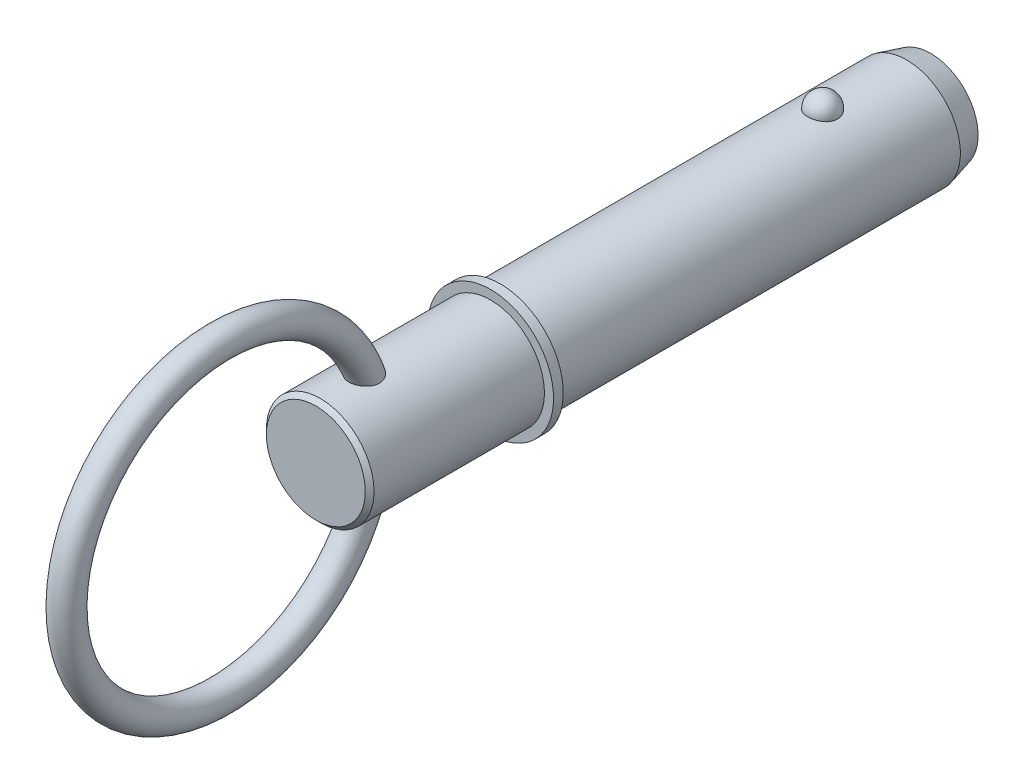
ISO-10303-21;
HEADER;
FILE_DESCRIPTION(('STEP AP214'),'2;1');
FILE_NAME('part.step','',(''),(''),'','','');
FILE_SCHEMA(('AUTOMOTIVE_DESIGN { 1 0 10303 214 1 1 1 1 }'));
ENDSEC;
DATA;
#1=APPLICATION_CONTEXT('core data for automotive mechanical design processes');
#2=APPLICATION_PROTOCOL_DEFINITION('international standard','automotive_design',2000,#1);
#3=PRODUCT_CONTEXT('',#1,'mechanical');
#4=PRODUCT('Part','Part','',(#3));
#5=PRODUCT_RELATED_PRODUCT_CATEGORY('part','',(#4));
#6=PRODUCT_DEFINITION_FORMATION('','',#4);
#7=PRODUCT_DEFINITION_CONTEXT('part definition',#1,'design');
#8=PRODUCT_DEFINITION('design','',#6,#7);
#9=PRODUCT_DEFINITION_SHAPE('','',#8);
#10=(LENGTH_UNIT() NAMED_UNIT(*) SI_UNIT(.MILLI.,.METRE.));
#11=(NAMED_UNIT(*) PLANE_ANGLE_UNIT() SI_UNIT($,.RADIAN.));
#12=(NAMED_UNIT(*) SI_UNIT($,.STERADIAN.) SOLID_ANGLE_UNIT());
#13=UNCERTAINTY_MEASURE_WITH_UNIT(LENGTH_MEASURE(1.E-05),#10,'distance_accuracy_value','');
#14=(GEOMETRIC_REPRESENTATION_CONTEXT(3) GLOBAL_UNCERTAINTY_ASSIGNED_CONTEXT((#13)) GLOBAL_UNIT_ASSIGNED_CONTEXT((#10,
#11,#12)) REPRESENTATION_CONTEXT('',''));
#15=CARTESIAN_POINT('',(0.,0.,0.));
#16=DIRECTION('',(0.,0.,1.));
#17=DIRECTION('',(1.,0.,0.));
#18=AXIS2_PLACEMENT_3D('',#15,#16,#17);
#19=CARTESIAN_POINT('',(0.,0.,63.5));
#20=DIRECTION('',(0.,0.,-1.));
#21=DIRECTION('',(-1.,0.,0.));
#22=AXIS2_PLACEMENT_3D('',#19,#20,#21);
#23=CYLINDRICAL_SURFACE('',#22,11.115);
#24=CARTESIAN_POINT('',(3.04058343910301,10.6910278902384,-3.07));
#25=CARTESIAN_POINT('',(3.04058039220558,10.6910304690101,-2.89837124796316));
#26=CARTESIAN_POINT('',(3.02657193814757,10.6950430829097,-2.72670368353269));
#27=CARTESIAN_POINT('',(2.97087341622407,10.7106465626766,-2.38822964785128));
#28=CARTESIAN_POINT('',(2.92917240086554,10.7222404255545,-2.22142512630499));
#29=CARTESIAN_POINT('',(2.81915317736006,10.751689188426,-1.89750816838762));
#30=CARTESIAN_POINT('',(2.75084669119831,10.7695413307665,-1.7403914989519));
#31=CARTESIAN_POINT('',(2.58932284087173,10.809510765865,-1.44013959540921));
#32=CARTESIAN_POINT('',(2.49610617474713,10.8316279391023,-1.29700396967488));
#33=CARTESIAN_POINT('',(2.28659317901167,10.877786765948,-1.02797591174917));
#34=CARTESIAN_POINT('',(2.17018825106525,10.9018371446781,-0.902169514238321));
#35=CARTESIAN_POINT('',(1.91759004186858,10.9490888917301,-0.672091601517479));
#36=CARTESIAN_POINT('',(1.78139672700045,10.9722902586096,-0.567820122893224));
#37=CARTESIAN_POINT('',(1.49327884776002,11.0151925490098,-0.383992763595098));
#38=CARTESIAN_POINT('',(1.34139928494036,11.034903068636,-0.304368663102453));
#39=CARTESIAN_POINT('',(1.02584823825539,11.0686948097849,-0.17173147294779));
#40=CARTESIAN_POINT('',(0.86217801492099,11.0827766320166,-0.118715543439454));
#41=CARTESIAN_POINT('',(0.530748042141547,11.1035404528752,-0.0415304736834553));
#42=CARTESIAN_POINT('',(0.363109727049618,11.1103474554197,-0.0168734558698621));
#43=CARTESIAN_POINT('',(0.0259327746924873,11.1162480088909,0.00453486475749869));
#44=CARTESIAN_POINT('',(-0.143605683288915,11.1153422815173,0.00128877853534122));
#45=CARTESIAN_POINT('',(-0.477280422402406,11.1059854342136,-0.0327676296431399));
#46=CARTESIAN_POINT('',(-0.641459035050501,11.0976393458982,-0.0631942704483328));
#47=CARTESIAN_POINT('',(-0.962236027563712,11.0744390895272,-0.150220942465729));
#48=CARTESIAN_POINT('',(-1.11883427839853,11.0595848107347,-0.206821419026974));
#49=CARTESIAN_POINT('',(-1.4210461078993,11.0248420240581,-0.34502889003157));
#50=CARTESIAN_POINT('',(-1.56659244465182,11.0049254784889,-0.426775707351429));
#51=CARTESIAN_POINT('',(-1.84189316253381,10.9622119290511,-0.612956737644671));
#52=CARTESIAN_POINT('',(-1.97164597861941,10.9394146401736,-0.717393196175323));
#53=CARTESIAN_POINT('',(-2.21432263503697,10.8929139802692,-0.948332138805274));
#54=CARTESIAN_POINT('',(-2.3268890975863,10.8692016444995,-1.07520847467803));
#55=CARTESIAN_POINT('',(-2.52940007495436,10.8238699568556,-1.34622145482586));
#56=CARTESIAN_POINT('',(-2.6193430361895,10.8022507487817,-1.49035928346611));
#57=CARTESIAN_POINT('',(-2.77523958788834,10.7632629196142,-1.79367507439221));
#58=CARTESIAN_POINT('',(-2.8409151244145,10.7459442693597,-1.95300253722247));
#59=CARTESIAN_POINT('',(-2.94519180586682,10.7178360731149,-2.28083009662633));
#60=CARTESIAN_POINT('',(-2.98379371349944,10.707046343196,-2.44932993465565));
#61=CARTESIAN_POINT('',(-3.03284665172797,10.6932559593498,-2.78998091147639));
#62=CARTESIAN_POINT('',(-3.04341313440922,10.6902233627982,-2.96211412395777));
#63=CARTESIAN_POINT('',(-3.03646037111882,10.6922002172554,-3.305762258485));
#64=CARTESIAN_POINT('',(-3.0189418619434,10.6972094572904,-3.47727719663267));
#65=CARTESIAN_POINT('',(-2.95641582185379,10.7146564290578,-3.81396465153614));
#66=CARTESIAN_POINT('',(-2.91154117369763,10.7270582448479,-3.97916375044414));
#67=CARTESIAN_POINT('',(-2.79553341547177,10.7578713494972,-4.29947360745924));
#68=CARTESIAN_POINT('',(-2.72439927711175,10.7762828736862,-4.45458397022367));
#69=CARTESIAN_POINT('',(-2.55718900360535,10.8171819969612,-4.75123550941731));
#70=CARTESIAN_POINT('',(-2.46098224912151,10.8396907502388,-4.89270014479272));
#71=CARTESIAN_POINT('',(-2.24623042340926,10.8862165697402,-5.15724095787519));
#72=CARTESIAN_POINT('',(-2.12768452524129,10.9102336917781,-5.28031645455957));
#73=CARTESIAN_POINT('',(-1.87085107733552,10.9571990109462,-5.5050961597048));
#74=CARTESIAN_POINT('',(-1.73249451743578,10.9801430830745,-5.60672245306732));
#75=CARTESIAN_POINT('',(-1.44010079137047,11.0223008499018,-5.78517789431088));
#76=CARTESIAN_POINT('',(-1.28606470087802,11.0415148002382,-5.86200874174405));
#77=CARTESIAN_POINT('',(-0.968615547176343,11.0738491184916,-5.98788441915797));
#78=CARTESIAN_POINT('',(-0.805339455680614,11.0870408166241,-6.03725610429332));
#79=CARTESIAN_POINT('',(-0.47244987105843,11.1062048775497,-6.10820004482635));
#80=CARTESIAN_POINT('',(-0.302837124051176,11.11217808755,-6.1297755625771));
#81=CARTESIAN_POINT('',(0.0345765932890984,11.1162034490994,-6.1443619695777));
#82=CARTESIAN_POINT('',(0.20235372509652,11.1143988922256,-6.13788957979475));
#83=CARTESIAN_POINT('',(0.534364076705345,11.103390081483,-6.09773981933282));
#84=CARTESIAN_POINT('',(0.698597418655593,11.094186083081,-6.06406338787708));
#85=CARTESIAN_POINT('',(1.01830314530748,11.0694136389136,-5.97063285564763));
#86=CARTESIAN_POINT('',(1.17380497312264,11.0538682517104,-5.91097318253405));
#87=CARTESIAN_POINT('',(1.472484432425,11.0180608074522,-5.76723645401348));
#88=CARTESIAN_POINT('',(1.6156613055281,10.9977984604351,-5.68315789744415));
#89=CARTESIAN_POINT('',(1.88801614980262,10.9543574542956,-5.49138807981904));
#90=CARTESIAN_POINT('',(2.01695079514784,10.9311394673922,-5.38336024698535));
#91=CARTESIAN_POINT('',(2.25501495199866,10.8845248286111,-5.14733839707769));
#92=CARTESIAN_POINT('',(2.36414099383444,10.8611281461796,-5.01934088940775));
#93=CARTESIAN_POINT('',(2.56152595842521,10.8162958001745,-4.74447932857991));
#94=CARTESIAN_POINT('',(2.64940088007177,10.7948999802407,-4.59733288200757));
#95=CARTESIAN_POINT('',(2.79961494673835,10.7569242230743,-4.29001203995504));
#96=CARTESIAN_POINT('',(2.86196390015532,10.7403424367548,-4.12984267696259));
#97=CARTESIAN_POINT('',(2.95377333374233,10.715429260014,-3.820623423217));
#98=CARTESIAN_POINT('',(2.98627018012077,10.7063495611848,-3.67252681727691));
#99=CARTESIAN_POINT('',(3.02967634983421,10.6941478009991,-3.37296350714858));
#100=CARTESIAN_POINT('',(3.04058612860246,10.6910256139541,-3.2214968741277));
#101=CARTESIAN_POINT('',(3.04058343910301,10.6910278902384,-3.07));
#102=B_SPLINE_CURVE_WITH_KNOTS('',3,(#24,#25,#26,#27,#28,#29,#30,#31,#32,#33,#34,#35,#36,#37,
#38,#39,#40,#41,#42,#43,#44,#45,#46,#47,#48,#49,#50,#51,#52,#53,#54,#55,#56,#57,#58,#59,#60,#61,
#62,#63,#64,#65,#66,#67,#68,#69,#70,#71,#72,#73,#74,#75,#76,#77,#78,#79,#80,#81,#82,#83,#84,#85,
#86,#87,#88,#89,#90,#91,#92,#93,#94,#95,#96,#97,#98,#99,#100,#101),.UNSPECIFIED.,.T.,.F.,(4,2,2,
2,2,2,2,2,2,2,2,2,2,2,2,2,2,2,2,2,2,2,2,2,2,2,2,2,2,2,2,2,2,2,2,2,2,2,4),(0.,0.514341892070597,
1.02888723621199,1.54320613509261,2.0575106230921,2.57428293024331,3.09105611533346,
3.60638589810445,4.1216606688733,4.62793159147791,5.1341551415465,5.63334381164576,
6.13254097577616,6.63456562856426,7.13663998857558,7.64804063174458,8.15947638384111,
8.6766026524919,9.19371435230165,9.70869321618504,10.223658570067,10.7361421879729,
11.2486458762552,11.7638748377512,12.2791228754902,12.7962115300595,13.3132647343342,
13.8240238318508,14.3347229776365,14.8360540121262,15.3373677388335,15.8368746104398,
16.3364121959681,16.8434736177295,17.3506237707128,17.8663484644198,18.3818748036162,
18.8358944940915,19.2899046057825),.UNSPECIFIED.);
#103=CARTESIAN_POINT('',(3.04058343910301,10.6910278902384,-3.07));
#104=VERTEX_POINT('',#103);
#105=EDGE_CURVE('E100',#104,#104,#102,.T.);
#106=ORIENTED_EDGE('',*,*,#105,.T.);
#107=EDGE_LOOP('',(#106));
#108=FACE_BOUND('',#107,.T.);
#109=CARTESIAN_POINT('',(0.,0.,-20.4));
#110=DIRECTION('',(0.,0.,-1.));
#111=DIRECTION('',(-1.,0.,0.));
#112=AXIS2_PLACEMENT_3D('',#109,#110,#111);
#113=CIRCLE('',#112,11.115);
#114=CARTESIAN_POINT('',(-11.115,0.,-20.4));
#115=VERTEX_POINT('',#114);
#116=EDGE_CURVE('E108',#115,#115,#113,.F.);
#117=ORIENTED_EDGE('',*,*,#116,.T.);
#118=EDGE_LOOP('',(#117));
#119=FACE_BOUND('',#118,.T.);
#120=CARTESIAN_POINT('',(0.,0.,63.5));
#121=DIRECTION('',(0.,0.,1.));
#122=DIRECTION('',(1.,0.,0.));
#123=AXIS2_PLACEMENT_3D('',#120,#121,#122);
#124=CIRCLE('',#123,11.115);
#125=CARTESIAN_POINT('',(11.115,0.,63.5));
#126=VERTEX_POINT('',#125);
#127=EDGE_CURVE('E106',#126,#126,#124,.T.);
#128=ORIENTED_EDGE('',*,*,#127,.F.);
#129=EDGE_LOOP('',(#128));
#130=FACE_BOUND('',#129,.T.);
#131=ADVANCED_FACE('F39',(#108,#119,#130),#23,.T.);
#132=CARTESIAN_POINT('',(0.,0.,-25.4));
#133=DIRECTION('',(0.,0.,-1.));
#134=DIRECTION('',(-1.,0.,0.));
#135=AXIS2_PLACEMENT_3D('',#132,#133,#134);
#136=PLANE('',#135);
#137=CARTESIAN_POINT('',(0.,0.,-25.4));
#138=DIRECTION('',(0.,0.,-1.));
#139=DIRECTION('',(-1.,0.,0.));
#140=AXIS2_PLACEMENT_3D('',#137,#138,#139);
#141=CIRCLE('',#140,9.77525403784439);
#142=CARTESIAN_POINT('',(-9.77525403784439,0.,-25.4));
#143=VERTEX_POINT('',#142);
#144=EDGE_CURVE('E143',#143,#143,#141,.T.);
#145=ORIENTED_EDGE('',*,*,#144,.T.);
#146=EDGE_LOOP('',(#145));
#147=FACE_BOUND('',#146,.T.);
#148=ADVANCED_FACE('F86',(#147),#136,.T.);
#149=CARTESIAN_POINT('',(0.,0.,-25.4));
#150=DIRECTION('',(0.,0.,1.));
#151=DIRECTION('',(1.,0.,0.));
#152=AXIS2_PLACEMENT_3D('',#149,#150,#151);
#153=CONICAL_SURFACE('',#152,9.77525403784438,0.261799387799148);
#154=ORIENTED_EDGE('',*,*,#116,.F.);
#155=EDGE_LOOP('',(#154));
#156=FACE_BOUND('',#155,.T.);
#157=ORIENTED_EDGE('',*,*,#144,.F.);
#158=EDGE_LOOP('',(#157));
#159=FACE_BOUND('',#158,.T.);
#160=ADVANCED_FACE('F92',(#156,#159),#153,.T.);
#161=CARTESIAN_POINT('',(0.,11.115,-3.07));
#162=DIRECTION('',(0.,1.,0.));
#163=DIRECTION('',(0.,0.,1.));
#164=AXIS2_PLACEMENT_3D('',#161,#162,#163);
#165=SPHERICAL_SURFACE('',#164,3.07);
#166=ORIENTED_EDGE('',*,*,#105,.F.);
#167=EDGE_LOOP('',(#166));
#168=FACE_BOUND('',#167,.T.);
#169=ADVANCED_FACE('F111',(#168),#165,.T.);
#170=CARTESIAN_POINT('',(0.,0.,63.5));
#171=DIRECTION('',(0.,0.,-1.));
#172=DIRECTION('',(-1.,0.,0.));
#173=AXIS2_PLACEMENT_3D('',#170,#171,#172);
#174=PLANE('',#173);
#175=ORIENTED_EDGE('',*,*,#127,.T.);
#176=EDGE_LOOP('',(#175));
#177=FACE_BOUND('',#176,.T.);
#178=CARTESIAN_POINT('',(0.,0.,63.5));
#179=DIRECTION('',(0.,0.,-1.));
#180=DIRECTION('',(-1.,0.,0.));
#181=AXIS2_PLACEMENT_3D('',#178,#179,#180);
#182=CIRCLE('',#181,13.);
#183=CARTESIAN_POINT('',(-13.,0.,63.5));
#184=VERTEX_POINT('',#183);
#185=EDGE_CURVE('E107',#184,#184,#182,.T.);
#186=ORIENTED_EDGE('',*,*,#185,.T.);
#187=EDGE_LOOP('',(#186));
#188=FACE_BOUND('',#187,.T.);
#189=ADVANCED_FACE('F115',(#177,#188),#174,.T.);
#190=CARTESIAN_POINT('',(0.,0.,33.7287874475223));
#191=DIRECTION('',(0.,0.,-1.));
#192=DIRECTION('',(-1.,0.,0.));
#193=AXIS2_PLACEMENT_3D('',#190,#191,#192);
#194=CYLINDRICAL_SURFACE('',#193,13.);
#195=CARTESIAN_POINT('',(0.,0.,65.5));
#196=DIRECTION('',(0.,0.,-1.));
#197=DIRECTION('',(-1.,0.,0.));
#198=AXIS2_PLACEMENT_3D('',#195,#196,#197);
#199=CIRCLE('',#198,13.);
#200=CARTESIAN_POINT('',(-13.,0.,65.5));
#201=VERTEX_POINT('',#200);
#202=EDGE_CURVE('E132',#201,#201,#199,.T.);
#203=ORIENTED_EDGE('',*,*,#202,.T.);
#204=EDGE_LOOP('',(#203));
#205=FACE_BOUND('',#204,.T.);
#206=ORIENTED_EDGE('',*,*,#185,.F.);
#207=EDGE_LOOP('',(#206));
#208=FACE_BOUND('',#207,.T.);
#209=ADVANCED_FACE('F119',(#205,#208),#194,.T.);
#210=CARTESIAN_POINT('',(0.,13.,65.5));
#211=DIRECTION('',(0.,0.,1.));
#212=DIRECTION('',(1.,0.,0.));
#213=AXIS2_PLACEMENT_3D('',#210,#211,#212);
#214=PLANE('',#213);
#215=CARTESIAN_POINT('',(0.,0.,65.5));
#216=DIRECTION('',(0.,0.,1.));
#217=DIRECTION('',(1.,0.,0.));
#218=AXIS2_PLACEMENT_3D('',#215,#216,#217);
#219=CIRCLE('',#218,11.115);
#220=CARTESIAN_POINT('',(11.115,0.,65.5));
#221=VERTEX_POINT('',#220);
#222=EDGE_CURVE('E110',#221,#221,#219,.T.);
#223=ORIENTED_EDGE('',*,*,#222,.F.);
#224=EDGE_LOOP('',(#223));
#225=FACE_BOUND('',#224,.T.);
#226=ORIENTED_EDGE('',*,*,#202,.F.);
#227=EDGE_LOOP('',(#226));
#228=FACE_BOUND('',#227,.T.);
#229=ADVANCED_FACE('F83',(#225,#228),#214,.T.);
#230=CARTESIAN_POINT('',(0.,0.,101.6));
#231=DIRECTION('',(0.,0.,-1.));
#232=DIRECTION('',(-1.,0.,0.));
#233=AXIS2_PLACEMENT_3D('',#230,#231,#232);
#234=CYLINDRICAL_SURFACE('',#233,11.115);
#235=CARTESIAN_POINT('',(-1.22435852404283,-11.0473603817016,88.6784197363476));
#236=CARTESIAN_POINT('',(-1.07078016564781,-11.0643805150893,88.6116991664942));
#237=CARTESIAN_POINT('',(-0.911372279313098,-11.0787777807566,88.5577454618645));
#238=CARTESIAN_POINT('',(-0.585451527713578,-11.1007717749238,88.4765522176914));
#239=CARTESIAN_POINT('',(-0.418938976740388,-11.1083688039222,88.4493114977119));
#240=CARTESIAN_POINT('',(-0.0835394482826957,-11.1159515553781,88.4221212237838));
#241=CARTESIAN_POINT('',(0.085347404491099,-11.1159376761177,88.4221702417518));
#242=CARTESIAN_POINT('',(0.420723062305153,-11.1083011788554,88.4495547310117));
#243=CARTESIAN_POINT('',(0.587211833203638,-11.1006784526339,88.4768905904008));
#244=CARTESIAN_POINT('',(0.91318995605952,-11.0786293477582,88.5582995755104));
#245=CARTESIAN_POINT('',(1.07267378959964,-11.0641977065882,88.6123933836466));
#246=CARTESIAN_POINT('',(1.37994044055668,-11.0300907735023,88.7461408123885));
#247=CARTESIAN_POINT('',(1.52772335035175,-11.0104155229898,88.8257942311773));
#248=CARTESIAN_POINT('',(1.80679367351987,-10.9680716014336,89.0084678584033));
#249=CARTESIAN_POINT('',(1.93814041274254,-10.945414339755,89.1114000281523));
#250=CARTESIAN_POINT('',(2.18117403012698,-10.8995884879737,89.338212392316));
#251=CARTESIAN_POINT('',(2.29286356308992,-10.8764199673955,89.4620897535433));
#252=CARTESIAN_POINT('',(2.49238969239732,-10.8324319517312,89.7259926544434));
#253=CARTESIAN_POINT('',(2.58046870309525,-10.8115899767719,89.8658312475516));
#254=CARTESIAN_POINT('',(2.73218762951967,-10.7742522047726,90.1586913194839));
#255=CARTESIAN_POINT('',(2.7958294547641,-10.757756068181,90.3117117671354));
#256=CARTESIAN_POINT('',(2.89767977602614,-10.7307723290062,90.6266092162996));
#257=CARTESIAN_POINT('',(2.93586554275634,-10.7202900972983,90.7884939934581));
#258=CARTESIAN_POINT('',(2.98678800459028,-10.7062139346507,91.1164805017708));
#259=CARTESIAN_POINT('',(2.99951894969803,-10.7026215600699,91.2825831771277));
#260=CARTESIAN_POINT('',(3.0004780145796,-10.7023530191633,91.6232270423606));
#261=CARTESIAN_POINT('',(2.98743421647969,-10.7060358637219,91.7977701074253));
#262=CARTESIAN_POINT('',(2.93592917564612,-10.7202719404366,92.1427508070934));
#263=CARTESIAN_POINT('',(2.8974582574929,-10.7308277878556,92.3131868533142));
#264=CARTESIAN_POINT('',(2.79180512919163,-10.7588257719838,92.6631149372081));
#265=CARTESIAN_POINT('',(2.72213928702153,-10.776850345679,92.8418115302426));
#266=CARTESIAN_POINT('',(2.55612841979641,-10.8174264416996,93.1859744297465));
#267=CARTESIAN_POINT('',(2.45975697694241,-10.8399824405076,93.3514274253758));
#268=CARTESIAN_POINT('',(2.23434632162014,-10.8887625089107,93.675672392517));
#269=CARTESIAN_POINT('',(2.10349593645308,-10.9151327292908,93.8331925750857));
#270=CARTESIAN_POINT('',(1.81505097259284,-10.96677510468,94.1216682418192));
#271=CARTESIAN_POINT('',(1.65749731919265,-10.9920488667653,94.2526637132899));
#272=CARTESIAN_POINT('',(1.36197799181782,-11.0319737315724,94.4513134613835));
#273=CARTESIAN_POINT('',(1.22927684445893,-11.0476896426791,94.5266009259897));
#274=CARTESIAN_POINT('',(0.952979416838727,-11.0749380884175,94.6545744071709));
#275=CARTESIAN_POINT('',(0.809393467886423,-11.0864745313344,94.7072815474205));
#276=CARTESIAN_POINT('',(0.513954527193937,-11.1041011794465,94.7870588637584));
#277=CARTESIAN_POINT('',(0.362058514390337,-11.1101594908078,94.8139789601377));
#278=CARTESIAN_POINT('',(0.0557792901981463,-11.1159132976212,94.8395595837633));
#279=CARTESIAN_POINT('',(-0.0986030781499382,-11.1156109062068,94.8382294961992));
#280=CARTESIAN_POINT('',(-0.389768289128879,-11.1090283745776,94.8089352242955));
#281=CARTESIAN_POINT('',(-0.526830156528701,-11.1033186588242,94.7835124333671));
#282=CARTESIAN_POINT('',(-0.794878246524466,-11.0873547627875,94.7112701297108));
#283=CARTESIAN_POINT('',(-0.925863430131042,-11.0770998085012,94.6644469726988));
#284=CARTESIAN_POINT('',(-1.18354406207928,-11.0525934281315,94.5498438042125));
#285=CARTESIAN_POINT('',(-1.30991621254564,-11.0382116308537,94.4813711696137));
#286=CARTESIAN_POINT('',(-1.55122352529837,-11.0068962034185,94.3271312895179));
#287=CARTESIAN_POINT('',(-1.66615377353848,-10.9899614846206,94.2413566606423));
#288=CARTESIAN_POINT('',(-1.90024050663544,-10.9520991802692,94.0408720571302));
#289=CARTESIAN_POINT('',(-2.01728342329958,-10.9309598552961,93.9237372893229));
#290=CARTESIAN_POINT('',(-2.23333659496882,-10.8888735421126,93.6738397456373));
#291=CARTESIAN_POINT('',(-2.33233396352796,-10.8679267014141,93.5410659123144));
#292=CARTESIAN_POINT('',(-2.52607041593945,-10.8246766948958,93.2400006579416));
#293=CARTESIAN_POINT('',(-2.61741570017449,-10.8027194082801,93.0694627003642));
#294=CARTESIAN_POINT('',(-2.77251687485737,-10.7639568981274,92.7156715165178));
#295=CARTESIAN_POINT('',(-2.8362578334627,-10.7471544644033,92.5324114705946));
#296=CARTESIAN_POINT('',(-2.93668505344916,-10.7201706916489,92.1466242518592));
#297=CARTESIAN_POINT('',(-2.97161961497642,-10.7104219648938,91.943594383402));
#298=CARTESIAN_POINT('',(-2.99683495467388,-10.7033740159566,91.6368749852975));
#299=CARTESIAN_POINT('',(-3.00070536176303,-10.7022882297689,91.5342341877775));
#300=CARTESIAN_POINT('',(-2.99908594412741,-10.7027439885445,91.3290499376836));
#301=CARTESIAN_POINT('',(-2.99360154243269,-10.7042840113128,91.2265064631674));
#302=CARTESIAN_POINT('',(-2.97382504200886,-10.7097936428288,91.0303300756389));
#303=CARTESIAN_POINT('',(-2.9602439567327,-10.7135669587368,90.9366192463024));
#304=CARTESIAN_POINT('',(-2.92480741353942,-10.723295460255,90.750932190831));
#305=CARTESIAN_POINT('',(-2.90295619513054,-10.7292495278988,90.6589551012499));
#306=CARTESIAN_POINT('',(-2.8509700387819,-10.7431800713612,90.4775474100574));
#307=CARTESIAN_POINT('',(-2.82083748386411,-10.7511559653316,90.3881160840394));
#308=CARTESIAN_POINT('',(-2.75241691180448,-10.7688750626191,90.2126453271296));
#309=CARTESIAN_POINT('',(-2.71412954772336,-10.7786181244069,90.1266056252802));
#310=CARTESIAN_POINT('',(-2.59550576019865,-10.807996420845,89.8910554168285));
#311=CARTESIAN_POINT('',(-2.50612224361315,-10.8292837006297,89.7461731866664));
#312=CARTESIAN_POINT('',(-2.30366035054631,-10.8741467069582,89.4745713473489));
#313=CARTESIAN_POINT('',(-2.19058370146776,-10.8977222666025,89.3478504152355));
#314=CARTESIAN_POINT('',(-1.94442412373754,-10.9443154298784,89.1164621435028));
#315=CARTESIAN_POINT('',(-1.81141354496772,-10.967334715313,89.0117182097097));
#316=CARTESIAN_POINT('',(-1.529042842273,-11.0102504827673,88.8264358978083));
#317=CARTESIAN_POINT('',(-1.37968206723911,-11.0301468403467,88.7458984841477));
#318=CARTESIAN_POINT('',(-1.22435852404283,-11.0473603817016,88.6784197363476));
#319=B_SPLINE_CURVE_WITH_KNOTS('',3,(#235,#236,#237,#238,#239,#240,#241,#242,#243,#244,#245,
#246,#247,#248,#249,#250,#251,#252,#253,#254,#255,#256,#257,#258,#259,#260,#261,#262,#263,#264,
#265,#266,#267,#268,#269,#270,#271,#272,#273,#274,#275,#276,#277,#278,#279,#280,#281,#282,#283,
#284,#285,#286,#287,#288,#289,#290,#291,#292,#293,#294,#295,#296,#297,#298,#299,#300,#301,#302,
#303,#304,#305,#306,#307,#308,#309,#310,#311,#312,#313,#314,#315,#316,#317,#318),.UNSPECIFIED.,
.T.,.F.,(4,2,2,2,2,2,2,2,2,2,2,2,2,2,2,2,2,2,2,2,2,2,2,2,2,2,2,2,2,2,2,2,2,2,2,2,2,2,2,2,2,4),
(0.,0.504317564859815,1.00861284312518,1.51288173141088,2.01715779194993,2.52182424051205,
3.02648670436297,3.52927157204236,4.03198848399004,4.52932690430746,5.02662645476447,
5.5243694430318,6.0222248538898,6.545261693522,7.06849767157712,7.64398785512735,
8.22004937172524,8.83633461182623,9.45168373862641,9.90997173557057,10.3678300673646,
10.8283372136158,11.2886913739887,11.7053264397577,12.1220324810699,12.5537129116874,
12.9855779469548,13.4844842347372,13.9837454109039,14.5653303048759,15.1472294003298,
15.762338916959,16.0701226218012,16.3777279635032,16.6616380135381,16.9454027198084,
17.229085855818,17.5127462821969,18.0246262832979,18.5364689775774,19.0464970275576,
19.5565453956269),.UNSPECIFIED.);
#320=CARTESIAN_POINT('',(-1.22435852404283,-11.0473603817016,88.6784197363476));
#321=VERTEX_POINT('',#320);
#322=EDGE_CURVE('E10',#321,#321,#319,.T.);
#323=ORIENTED_EDGE('',*,*,#322,.F.);
#324=EDGE_LOOP('',(#323));
#325=FACE_BOUND('',#324,.T.);
#326=CARTESIAN_POINT('',(-1.22435852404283,11.0473603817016,88.6784197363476));
#327=CARTESIAN_POINT('',(-1.37630771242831,11.0305212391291,88.744431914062));
#328=CARTESIAN_POINT('',(-1.52254325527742,11.0111158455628,88.8229381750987));
#329=CARTESIAN_POINT('',(-1.79945383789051,10.9692671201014,89.0031533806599));
#330=CARTESIAN_POINT('',(-1.93013010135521,10.9468240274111,89.1048604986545));
#331=CARTESIAN_POINT('',(-2.17227655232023,10.9013603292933,89.3290359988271));
#332=CARTESIAN_POINT('',(-2.28373752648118,10.8783394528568,89.4515142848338));
#333=CARTESIAN_POINT('',(-2.48427458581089,10.8343057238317,89.7138954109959));
#334=CARTESIAN_POINT('',(-2.57335330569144,10.8132926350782,89.8537961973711));
#335=CARTESIAN_POINT('',(-2.7264007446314,10.7757209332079,90.1459648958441));
#336=CARTESIAN_POINT('',(-2.79054231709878,10.7591319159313,90.2981385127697));
#337=CARTESIAN_POINT('',(-2.89354234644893,10.7318913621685,90.6112862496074));
#338=CARTESIAN_POINT('',(-2.93239912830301,10.7212402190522,90.7722609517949));
#339=CARTESIAN_POINT('',(-2.98540436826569,10.7066038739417,91.1019559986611));
#340=CARTESIAN_POINT('',(-2.9990165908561,10.7027634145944,91.2707680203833));
#341=CARTESIAN_POINT('',(-3.0008814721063,10.7022388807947,91.6085087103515));
#342=CARTESIAN_POINT('',(-2.98912652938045,10.7055569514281,91.7774373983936));
#343=CARTESIAN_POINT('',(-2.93985175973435,10.7191979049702,92.1248560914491));
#344=CARTESIAN_POINT('',(-2.90036626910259,10.7300544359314,92.3030445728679));
#345=CARTESIAN_POINT('',(-2.7955500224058,10.7578360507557,92.6512150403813));
#346=CARTESIAN_POINT('',(-2.73019988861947,10.774765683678,92.8211907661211));
#347=CARTESIAN_POINT('',(-2.56762574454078,10.8147227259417,93.1657841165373));
#348=CARTESIAN_POINT('',(-2.46786230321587,10.838191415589,93.3391574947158));
#349=CARTESIAN_POINT('',(-2.24100420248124,10.8873575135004,93.6666868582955));
#350=CARTESIAN_POINT('',(-2.11391925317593,10.9130541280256,93.8208496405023));
#351=CARTESIAN_POINT('',(-1.85542700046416,10.9597063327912,94.0827355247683));
#352=CARTESIAN_POINT('',(-1.72758345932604,10.9807909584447,94.1939559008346));
#353=CARTESIAN_POINT('',(-1.45489931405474,11.0202250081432,94.3941223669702));
#354=CARTESIAN_POINT('',(-1.31006770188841,11.0385758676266,94.4830801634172));
#355=CARTESIAN_POINT('',(-1.08171164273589,11.0625084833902,94.5963702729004));
#356=CARTESIAN_POINT('',(-1.00332234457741,11.069914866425,94.6308967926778));
#357=CARTESIAN_POINT('',(-0.843525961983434,11.0832350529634,94.6923914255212));
#358=CARTESIAN_POINT('',(-0.762120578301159,11.0891496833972,94.7193637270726));
#359=CARTESIAN_POINT('',(-0.5970144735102,11.0992628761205,94.7651819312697));
#360=CARTESIAN_POINT('',(-0.513315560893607,11.1034627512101,94.7840340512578));
#361=CARTESIAN_POINT('',(-0.344374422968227,11.1099851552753,94.8132096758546));
#362=CARTESIAN_POINT('',(-0.259132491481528,11.1123080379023,94.8235347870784));
#363=CARTESIAN_POINT('',(-0.100838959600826,11.114780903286,94.8345196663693));
#364=CARTESIAN_POINT('',(-0.0278735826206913,11.1152042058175,94.836395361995));
#365=CARTESIAN_POINT('',(0.117962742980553,11.1146132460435,94.8337734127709));
#366=CARTESIAN_POINT('',(0.190833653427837,11.1135985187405,94.8292737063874));
#367=CARTESIAN_POINT('',(0.335842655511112,11.110161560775,94.8139786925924));
#368=CARTESIAN_POINT('',(0.407981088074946,11.1077400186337,94.8031864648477));
#369=CARTESIAN_POINT('',(0.551029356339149,11.1015643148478,94.775503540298));
#370=CARTESIAN_POINT('',(0.62193870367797,11.0978096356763,94.7586104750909));
#371=CARTESIAN_POINT('',(0.825381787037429,11.0851145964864,94.7010547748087));
#372=CARTESIAN_POINT('',(0.955713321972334,11.0745538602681,94.6527059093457));
#373=CARTESIAN_POINT('',(1.20733127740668,11.0499605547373,94.5373252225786));
#374=CARTESIAN_POINT('',(1.328615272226,11.0359270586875,94.4702884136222));
#375=CARTESIAN_POINT('',(1.57344360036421,11.0038352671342,94.3118439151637));
#376=CARTESIAN_POINT('',(1.69572941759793,10.9855025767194,94.2185512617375));
#377=CARTESIAN_POINT('',(1.92565215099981,10.9475431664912,94.0156505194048));
#378=CARTESIAN_POINT('',(2.03328016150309,10.9279156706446,93.9060325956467));
#379=CARTESIAN_POINT('',(2.25048911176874,10.8854412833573,93.6529911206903));
#380=CARTESIAN_POINT('',(2.35710396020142,10.8626332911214,93.5070101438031));
#381=CARTESIAN_POINT('',(2.54757318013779,10.8195493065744,93.200478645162));
#382=CARTESIAN_POINT('',(2.63141052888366,10.799275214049,93.0399173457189));
#383=CARTESIAN_POINT('',(2.78342312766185,10.7611645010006,92.6878272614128));
#384=CARTESIAN_POINT('',(2.84851472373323,10.7439117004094,92.4948938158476));
#385=CARTESIAN_POINT('',(2.9456265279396,10.7177011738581,92.1001309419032));
#386=CARTESIAN_POINT('',(2.97764942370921,10.7087427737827,91.8983022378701));
#387=CARTESIAN_POINT('',(2.99864828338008,10.7028651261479,91.5959897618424));
#388=CARTESIAN_POINT('',(3.00125529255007,10.7021342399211,91.4963789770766));
#389=CARTESIAN_POINT('',(2.9976304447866,10.7031517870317,91.2973450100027));
#390=CARTESIAN_POINT('',(2.99140295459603,10.704898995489,91.1979217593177));
#391=CARTESIAN_POINT('',(2.96990080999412,10.710883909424,91.0001790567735));
#392=CARTESIAN_POINT('',(2.95463019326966,10.7151205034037,90.9018591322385));
#393=CARTESIAN_POINT('',(2.91493260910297,10.7259879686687,90.7072196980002));
#394=CARTESIAN_POINT('',(2.89050674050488,10.7326185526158,90.6108999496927));
#395=CARTESIAN_POINT('',(2.83556656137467,10.7472556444,90.4312221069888));
#396=CARTESIAN_POINT('',(2.8059633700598,10.7550439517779,90.3475666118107));
#397=CARTESIAN_POINT('',(2.73953102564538,10.7721572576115,90.1833000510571));
#398=CARTESIAN_POINT('',(2.70269935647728,10.7814827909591,90.1026900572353));
#399=CARTESIAN_POINT('',(2.62203440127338,10.801383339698,89.9452733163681));
#400=CARTESIAN_POINT('',(2.57820565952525,10.8119575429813,89.8684641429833));
#401=CARTESIAN_POINT('',(2.48382482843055,10.8340293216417,89.7192237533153));
#402=CARTESIAN_POINT('',(2.43327032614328,10.8455272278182,89.646794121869));
#403=CARTESIAN_POINT('',(2.27895739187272,10.879345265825,89.4459926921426));
#404=CARTESIAN_POINT('',(2.1671718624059,10.9023791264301,89.3237643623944));
#405=CARTESIAN_POINT('',(1.92442677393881,10.9478318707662,89.1001515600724));
#406=CARTESIAN_POINT('',(1.79346836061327,10.9702507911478,88.998765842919));
#407=CARTESIAN_POINT('',(1.51657151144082,11.0119360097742,88.8195646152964));
#408=CARTESIAN_POINT('',(1.37069187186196,11.0312139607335,88.7416610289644));
#409=CARTESIAN_POINT('',(1.06764402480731,11.0646548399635,88.6106801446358));
#410=CARTESIAN_POINT('',(0.910475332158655,11.0788175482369,88.5576039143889));
#411=CARTESIAN_POINT('',(0.587492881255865,11.1006548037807,88.47697871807));
#412=CARTESIAN_POINT('',(0.421604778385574,11.1082585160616,88.4497081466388));
#413=CARTESIAN_POINT('',(0.0874262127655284,11.1159127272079,88.4222592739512));
#414=CARTESIAN_POINT('',(-0.0808643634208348,11.1159628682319,88.4220822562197));
#415=CARTESIAN_POINT('',(-0.416252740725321,11.1084780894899,88.4489180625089));
#416=CARTESIAN_POINT('',(-0.583334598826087,11.1008914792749,88.476116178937));
#417=CARTESIAN_POINT('',(-0.91035502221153,11.0788693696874,88.5574015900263));
#418=CARTESIAN_POINT('',(-1.07029370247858,11.064433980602,88.6114884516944));
#419=CARTESIAN_POINT('',(-1.22435852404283,11.0473603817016,88.6784197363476));
#420=B_SPLINE_CURVE_WITH_KNOTS('',3,(#326,#327,#328,#329,#330,#331,#332,#333,#334,#335,#336,
#337,#338,#339,#340,#341,#342,#343,#344,#345,#346,#347,#348,#349,#350,#351,#352,#353,#354,#355,
#356,#357,#358,#359,#360,#361,#362,#363,#364,#365,#366,#367,#368,#369,#370,#371,#372,#373,#374,
#375,#376,#377,#378,#379,#380,#381,#382,#383,#384,#385,#386,#387,#388,#389,#390,#391,#392,#393,
#394,#395,#396,#397,#398,#399,#400,#401,#402,#403,#404,#405,#406,#407,#408,#409,#410,#411,#412,
#413,#414,#415,#416,#417,#418,#419),.UNSPECIFIED.,.T.,.F.,(4,2,2,2,2,2,2,2,2,2,2,2,2,2,2,2,2,2,
2,2,2,2,2,2,2,2,2,2,2,2,2,2,2,2,2,2,2,2,2,2,2,2,2,2,2,2,4),(0.,0.498977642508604,
0.997916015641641,1.49709295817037,1.99621111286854,2.4918051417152,2.98743199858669,
3.49347125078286,3.99966216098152,4.54591839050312,5.09258465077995,5.69407889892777,
6.29535972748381,6.80565832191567,7.31568801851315,7.57328514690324,7.83073916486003,
8.08799570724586,8.34520376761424,8.5638916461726,8.78265025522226,9.00130188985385,
9.22003849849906,9.63638938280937,10.0528514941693,10.5157946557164,10.9790178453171,
11.5234572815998,12.0683024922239,12.6784825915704,13.288613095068,13.5872082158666,
13.8856557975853,14.1839702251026,14.482248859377,14.7491407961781,15.016125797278,
15.2829381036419,15.5498463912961,16.0489312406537,16.5479862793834,17.0451454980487,
17.542326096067,18.0448111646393,18.5473200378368,19.0532532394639,19.5591782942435),.UNSPECIFIED.);
#421=CARTESIAN_POINT('',(-1.22435852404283,11.0473603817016,88.6784197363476));
#422=VERTEX_POINT('',#421);
#423=EDGE_CURVE('E51',#422,#422,#420,.T.);
#424=ORIENTED_EDGE('',*,*,#423,.F.);
#425=EDGE_LOOP('',(#424));
#426=FACE_BOUND('',#425,.T.);
#427=CARTESIAN_POINT('',(0.,0.,100.7));
#428=DIRECTION('',(0.,0.,-1.));
#429=DIRECTION('',(-1.,0.,0.));
#430=AXIS2_PLACEMENT_3D('',#427,#428,#429);
#431=CIRCLE('',#430,11.115);
#432=CARTESIAN_POINT('',(-11.115,0.,100.7));
#433=VERTEX_POINT('',#432);
#434=EDGE_CURVE('E62',#433,#433,#431,.T.);
#435=ORIENTED_EDGE('',*,*,#434,.T.);
#436=EDGE_LOOP('',(#435));
#437=FACE_BOUND('',#436,.T.);
#438=ORIENTED_EDGE('',*,*,#222,.T.);
#439=EDGE_LOOP('',(#438));
#440=FACE_BOUND('',#439,.T.);
#441=ADVANCED_FACE('F67',(#325,#426,#437,#440),#234,.T.);
#442=CARTESIAN_POINT('',(0.,0.,101.6));
#443=DIRECTION('',(0.,0.,-1.));
#444=DIRECTION('',(-1.,0.,0.));
#445=AXIS2_PLACEMENT_3D('',#442,#443,#444);
#446=PLANE('',#445);
#447=CARTESIAN_POINT('',(0.,0.,101.6));
#448=DIRECTION('',(0.,0.,-1.));
#449=DIRECTION('',(-1.,0.,0.));
#450=AXIS2_PLACEMENT_3D('',#447,#448,#449);
#451=CIRCLE('',#450,10.215);
#452=CARTESIAN_POINT('',(-10.215,0.,101.6));
#453=VERTEX_POINT('',#452);
#454=EDGE_CURVE('E57',#453,#453,#451,.F.);
#455=ORIENTED_EDGE('',*,*,#454,.T.);
#456=EDGE_LOOP('',(#455));
#457=FACE_BOUND('',#456,.T.);
#458=ADVANCED_FACE('F74',(#457),#446,.F.);
#459=CARTESIAN_POINT('',(0.,0.,100.7));
#460=DIRECTION('',(0.,0.,-1.));
#461=DIRECTION('',(-1.,0.,0.));
#462=AXIS2_PLACEMENT_3D('',#459,#460,#461);
#463=CONICAL_SURFACE('',#462,11.115,0.785398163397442);
#464=CARTESIAN_POINT('',(-10.215,0.,101.6));
#465=CARTESIAN_POINT('',(-10.224375,0.,101.590625));
#466=CARTESIAN_POINT('',(-10.23375,0.,101.58125));
#467=CARTESIAN_POINT('',(-10.2525,0.,101.5625));
#468=CARTESIAN_POINT('',(-10.261875,0.,101.553125));
#469=CARTESIAN_POINT('',(-10.280625,0.,101.534375));
#470=CARTESIAN_POINT('',(-10.29,0.,101.525));
#471=CARTESIAN_POINT('',(-10.30875,0.,101.50625));
#472=CARTESIAN_POINT('',(-10.318125,0.,101.496875));
#473=CARTESIAN_POINT('',(-10.336875,0.,101.478125));
#474=CARTESIAN_POINT('',(-10.34625,0.,101.46875));
#475=CARTESIAN_POINT('',(-10.365,0.,101.45));
#476=CARTESIAN_POINT('',(-10.374375,0.,101.440625));
#477=CARTESIAN_POINT('',(-10.393125,0.,101.421875));
#478=CARTESIAN_POINT('',(-10.4025,0.,101.4125));
#479=CARTESIAN_POINT('',(-10.42125,0.,101.39375));
#480=CARTESIAN_POINT('',(-10.430625,0.,101.384375));
#481=CARTESIAN_POINT('',(-10.449375,0.,101.365625));
#482=CARTESIAN_POINT('',(-10.45875,0.,101.35625));
#483=CARTESIAN_POINT('',(-10.4775,0.,101.3375));
#484=CARTESIAN_POINT('',(-10.486875,0.,101.328125));
#485=CARTESIAN_POINT('',(-10.505625,0.,101.309375));
#486=CARTESIAN_POINT('',(-10.515,0.,101.3));
#487=CARTESIAN_POINT('',(-10.53375,0.,101.28125));
#488=CARTESIAN_POINT('',(-10.543125,0.,101.271875));
#489=CARTESIAN_POINT('',(-10.561875,0.,101.253125));
#490=CARTESIAN_POINT('',(-10.57125,0.,101.24375));
#491=CARTESIAN_POINT('',(-10.59,0.,101.225));
#492=CARTESIAN_POINT('',(-10.599375,0.,101.215625));
#493=CARTESIAN_POINT('',(-10.618125,0.,101.196875));
#494=CARTESIAN_POINT('',(-10.6275,0.,101.1875));
#495=CARTESIAN_POINT('',(-10.64625,0.,101.16875));
#496=CARTESIAN_POINT('',(-10.655625,0.,101.159375));
#497=CARTESIAN_POINT('',(-10.674375,0.,101.140625));
#498=CARTESIAN_POINT('',(-10.68375,0.,101.13125));
#499=CARTESIAN_POINT('',(-10.7025,0.,101.1125));
#500=CARTESIAN_POINT('',(-10.711875,0.,101.103125));
#501=CARTESIAN_POINT('',(-10.730625,0.,101.084375));
#502=CARTESIAN_POINT('',(-10.74,0.,101.075));
#503=CARTESIAN_POINT('',(-10.75875,0.,101.05625));
#504=CARTESIAN_POINT('',(-10.768125,0.,101.046875));
#505=CARTESIAN_POINT('',(-10.786875,0.,101.028125));
#506=CARTESIAN_POINT('',(-10.79625,0.,101.01875));
#507=CARTESIAN_POINT('',(-10.815,0.,101.));
#508=CARTESIAN_POINT('',(-10.824375,0.,100.990625));
#509=CARTESIAN_POINT('',(-10.843125,0.,100.971875));
#510=CARTESIAN_POINT('',(-10.8525,0.,100.9625));
#511=CARTESIAN_POINT('',(-10.87125,0.,100.94375));
#512=CARTESIAN_POINT('',(-10.880625,0.,100.934375));
#513=CARTESIAN_POINT('',(-10.899375,0.,100.915625));
#514=CARTESIAN_POINT('',(-10.90875,0.,100.90625));
#515=CARTESIAN_POINT('',(-10.9275,0.,100.8875));
#516=CARTESIAN_POINT('',(-10.936875,0.,100.878125));
#517=CARTESIAN_POINT('',(-10.955625,0.,100.859375));
#518=CARTESIAN_POINT('',(-10.965,0.,100.85));
#519=CARTESIAN_POINT('',(-10.98375,0.,100.83125));
#520=CARTESIAN_POINT('',(-10.993125,0.,100.821875));
#521=CARTESIAN_POINT('',(-11.011875,0.,100.803125));
#522=CARTESIAN_POINT('',(-11.02125,0.,100.79375));
#523=CARTESIAN_POINT('',(-11.04,0.,100.775));
#524=CARTESIAN_POINT('',(-11.049375,0.,100.765625));
#525=CARTESIAN_POINT('',(-11.068125,0.,100.746875));
#526=CARTESIAN_POINT('',(-11.0775,0.,100.7375));
#527=CARTESIAN_POINT('',(-11.09625,0.,100.71875));
#528=CARTESIAN_POINT('',(-11.105625,0.,100.709375));
#529=CARTESIAN_POINT('',(-11.115,0.,100.7));
#530=B_SPLINE_CURVE_WITH_KNOTS('',3,(#464,#465,#466,#467,#468,#469,#470,#471,#472,#473,#474,
#475,#476,#477,#478,#479,#480,#481,#482,#483,#484,#485,#486,#487,#488,#489,#490,#491,#492,#493,
#494,#495,#496,#497,#498,#499,#500,#501,#502,#503,#504,#505,#506,#507,#508,#509,#510,#511,#512,
#513,#514,#515,#516,#517,#518,#519,#520,#521,#522,#523,#524,#525,#526,#527,#528,#529),
.UNSPECIFIED.,.F.,.F.,(4,2,2,2,2,2,2,2,2,2,2,2,2,2,2,2,2,2,2,2,2,2,2,2,2,2,2,2,2,2,2,2,4),(0.,
0.0397747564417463,0.0795495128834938,0.11932426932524,0.159099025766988,0.198873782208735,
0.238648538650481,0.278423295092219,0.318198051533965,0.357972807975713,0.397747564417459,
0.437522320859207,0.477297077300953,0.517071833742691,0.556846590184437,0.596621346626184,
0.636396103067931,0.676170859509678,0.715945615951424,0.755720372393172,0.79549512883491,
0.835269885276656,0.875044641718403,0.91481939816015,0.954594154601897,0.994368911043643,
1.03414366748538,1.07391842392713,1.11369318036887,1.15346793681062,1.19324269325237,
1.23301744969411,1.27279220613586),.UNSPECIFIED.);
#531=EDGE_CURVE('BSEAM41',#453,#433,#530,.T.);
#532=ORIENTED_EDGE('',*,*,#454,.F.);
#533=ORIENTED_EDGE('',*,*,#434,.F.);
#534=ORIENTED_EDGE('',*,*,#531,.T.);
#535=ORIENTED_EDGE('',*,*,#531,.F.);
#536=EDGE_LOOP('',(#532,#534,#533,#535));
#537=FACE_BOUND('',#536,.T.);
#538=ADVANCED_FACE('F41',(#537),#463,.T.);
#539=CARTESIAN_POINT('',(0.,0.,121.35));
#540=DIRECTION('',(1.,0.,0.));
#541=DIRECTION('',(0.,0.,-1.));
#542=AXIS2_PLACEMENT_3D('',#539,#540,#541);
#543=TOROIDAL_SURFACE('',#542,31.75,3.);
#544=ORIENTED_EDGE('',*,*,#322,.T.);
#545=EDGE_LOOP('',(#544));
#546=FACE_BOUND('',#545,.T.);
#547=ORIENTED_EDGE('',*,*,#423,.T.);
#548=EDGE_LOOP('',(#547));
#549=FACE_BOUND('',#548,.T.);
#550=ADVANCED_FACE('F71',(#546,#549),#543,.T.);
#551=CLOSED_SHELL('',(#131,#148,#160,#169,#189,#209,#229,#441,#458,#538,#550));
#552=MANIFOLD_SOLID_BREP('B2',#551);
#553=ADVANCED_BREP_SHAPE_REPRESENTATION('',(#18,#552),#14);
#554=SHAPE_DEFINITION_REPRESENTATION(#9,#553);
ENDSEC;
END-ISO-10303-21;
